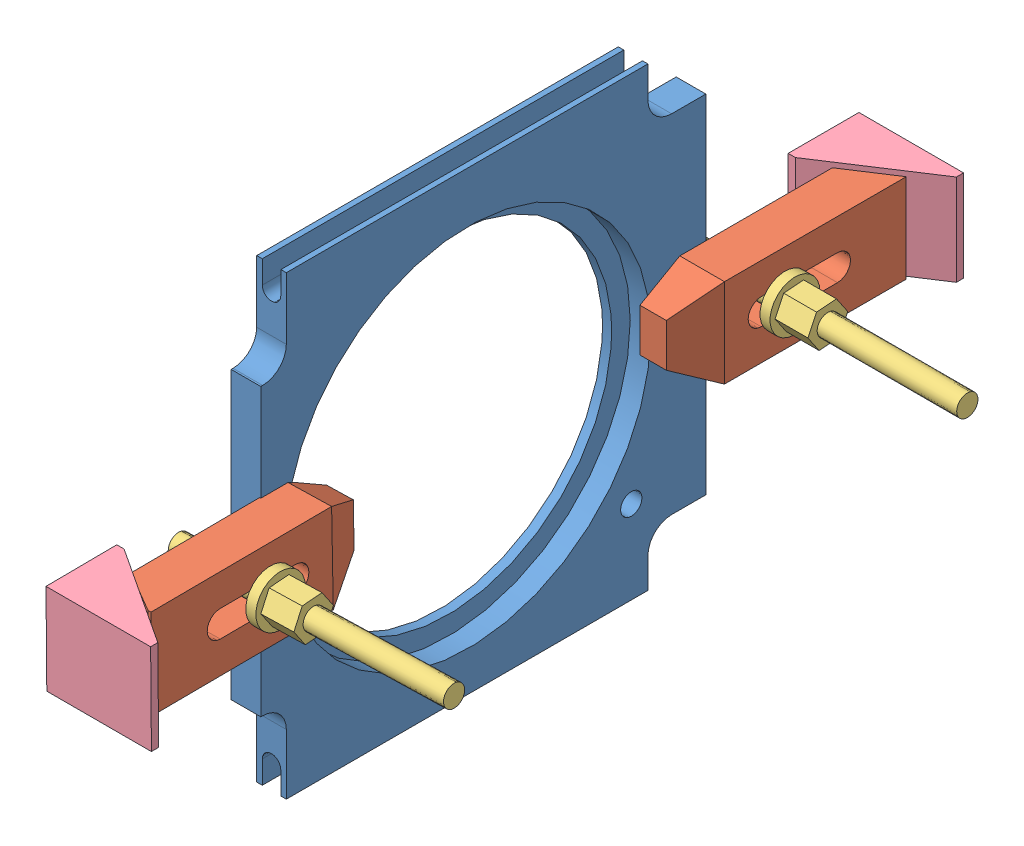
SolidWorks assembly Undercut-assy.SLDASM, configuration E-W clamps for setup 2 (file format 13000). Lengths in mm.
Overall size (76.53 127 226.42).
13 component instances, 4 part files, 6 mates.
Components (placement in the parent):
- Fixture-assy-1: Fixture-assy.SLDPRT [Default] at origin
- Short-clamp-bolt-1: Short-clamp-bolt.SLDPRT [Default] at (23.4717 75.4549 -73.5626) x (0 0 1) z (1 0 0) (suppressed, hidden)
- Short-clamp-toe-6: Short-clamp-toe.SLDPRT [Default] at (11.0257 -0.3737 -3.6835) x (0 -1 0) z (1 0 0) (suppressed, hidden)
- Short-clamp-bolt-7: Short-clamp-bolt.SLDPRT [Default] at (23.4717 -72.5335 -74.2724) x (0 0 1) z (1 0 0) (suppressed, hidden)
- Short-clamp-toe-8: Short-clamp-toe.SLDPRT [Default] at (11.0257 1.6359 -3.5659) x (0 0.999962 -0.008727) z (1 0 0) (suppressed, hidden)
- Short-clamp-wedge-2: Short-clamp-wedge.SLDPRT [Default] at (0 0.0449 -17.1311) (suppressed, hidden)
- Short-clamp-wedge-3: Short-clamp-wedge.SLDPRT [Default] at (0 1.724 9.5481) x (1 0 0) z (0 0.008727 -0.999962) (suppressed, hidden)
- Short-clamp-toe-2: Short-clamp-toe.SLDPRT [Default] at (7.7665 1.8577 -3.62) x (0.006405 -0.000232 0.999979) z (0.99981 0.018417 -0.006399)
- Short-clamp-bolt-2: Short-clamp-bolt.SLDPRT [Default] at (20.2194 1.9042 -2.7786) x (0.006399 0.000059 0.99998) z (0.99981 0.018417 -0.006399)
- Short-clamp-bolt-6: Short-clamp-bolt.SLDPRT [Default] at (20.701 1.4785 -146.0169) x (0 0 1) z (1 0 0)
- Short-clamp-toe-7: Short-clamp-toe.SLDPRT [Default] at (8.255 1.9556 -5.2628) x (0 0 -1) z (1 0 0)
- Short-clamp-wedge-4: Short-clamp-wedge.SLDPRT [Default] at (0 15.5889 -3.5264) x (1 0 0) z (0 -0.999962 -0.008727)
- Short-clamp-wedge-5: Short-clamp-wedge.SLDPRT [Default] at (0 -9.701 -4.3577) x (1 0 0) z (0 1 0)
Mates (geometry in assembly coordinates):
- Coincident4: coincident anti-aligned: plane of Short-clamp-toe-2 through (20.2101 2.0869 -3.6996) normal (0.99981 0.018417 -0.006399); plane of Short-clamp-bolt-2 through (20.6685 1.9083 67.3948) normal (-0.99981 -0.018417 0.006399)
- Coincident7: coincident anti-aligned: plane of Short-clamp-bolt-6 through (20.701 1.4785 -75.842) normal (-1 0 0); plane of Short-clamp-toe-7 through (20.701 1.9556 -5.2628) normal (1 0 0)
- Coincident8: coincident anti-aligned: plane of Short-clamp-toe-6 through (23.4717 -2.5229 -3.6398) normal (1 0 0); plane of Short-clamp-bolt-7 through (23.4717 -72.5335 -4.0975) normal (-1 0 0)
- Coincident13: coincident aligned: plane of Fixture-assy-1 through (0 -45.1326 57.186) normal (-1 0 0); plane of Short-clamp-wedge-2 through (0 93.1191 8.2689) normal (-1 0 0)
- Coincident14: coincident aligned: plane of Fixture-assy-1 through (0 -45.1326 57.186) normal (-1 0 0); plane of Short-clamp-wedge-5 through (0 15.699 -97.4319) normal (-1 0 0)
- Coincident16: coincident aligned: plane of Fixture-assy-1 through (0 -45.1326 57.186) normal (-1 0 0); plane of Short-clamp-wedge-3 through (0 -91.125 -16.6631) normal (-1 0 0)
